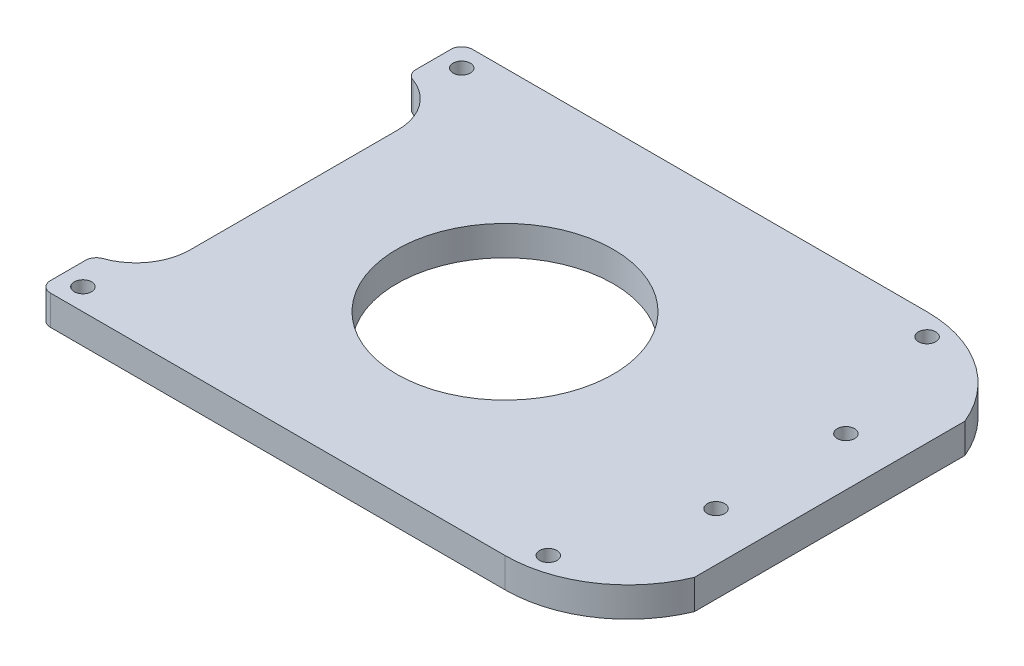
ISO-10303-21;
HEADER;
FILE_DESCRIPTION(('STEP AP214'),'2;1');
FILE_NAME('part.step','',(''),(''),'','','');
FILE_SCHEMA(('AUTOMOTIVE_DESIGN { 1 0 10303 214 1 1 1 1 }'));
ENDSEC;
DATA;
#1=APPLICATION_CONTEXT('core data for automotive mechanical design processes');
#2=APPLICATION_PROTOCOL_DEFINITION('international standard','automotive_design',2000,#1);
#3=PRODUCT_CONTEXT('',#1,'mechanical');
#4=PRODUCT('Part','Part','',(#3));
#5=PRODUCT_RELATED_PRODUCT_CATEGORY('part','',(#4));
#6=PRODUCT_DEFINITION_FORMATION('','',#4);
#7=PRODUCT_DEFINITION_CONTEXT('part definition',#1,'design');
#8=PRODUCT_DEFINITION('design','',#6,#7);
#9=PRODUCT_DEFINITION_SHAPE('','',#8);
#10=(LENGTH_UNIT() NAMED_UNIT(*) SI_UNIT(.MILLI.,.METRE.));
#11=(NAMED_UNIT(*) PLANE_ANGLE_UNIT() SI_UNIT($,.RADIAN.));
#12=(NAMED_UNIT(*) SI_UNIT($,.STERADIAN.) SOLID_ANGLE_UNIT());
#13=UNCERTAINTY_MEASURE_WITH_UNIT(LENGTH_MEASURE(1.E-05),#10,'distance_accuracy_value','');
#14=(GEOMETRIC_REPRESENTATION_CONTEXT(3) GLOBAL_UNCERTAINTY_ASSIGNED_CONTEXT((#13)) GLOBAL_UNIT_ASSIGNED_CONTEXT((#10,
#11,#12)) REPRESENTATION_CONTEXT('',''));
#15=CARTESIAN_POINT('',(0.,0.,0.));
#16=DIRECTION('',(0.,0.,1.));
#17=DIRECTION('',(1.,0.,0.));
#18=AXIS2_PLACEMENT_3D('',#15,#16,#17);
#19=CARTESIAN_POINT('',(39.,5.5,-16.25));
#20=DIRECTION('',(0.,-1.,0.));
#21=DIRECTION('',(0.,0.,-1.));
#22=AXIS2_PLACEMENT_3D('',#19,#20,#21);
#23=PLANE('',#22);
#24=DIRECTION('',(-1.,0.,0.));
#25=VECTOR('',#24,1.);
#26=CARTESIAN_POINT('',(-39.,5.5,-39.));
#27=LINE('',#26,#25);
#28=CARTESIAN_POINT('',(39.,5.5,-39.));
#29=VERTEX_POINT('',#28);
#30=CARTESIAN_POINT('',(-45.,5.5,-39.));
#31=VERTEX_POINT('',#30);
#32=EDGE_CURVE('E205',#29,#31,#27,.T.);
#33=ORIENTED_EDGE('',*,*,#32,.T.);
#34=CARTESIAN_POINT('',(-45.,5.5,-37.));
#35=DIRECTION('',(0.,-1.,0.));
#36=DIRECTION('',(0.,0.,-1.));
#37=AXIS2_PLACEMENT_3D('',#34,#35,#36);
#38=CIRCLE('',#37,2.);
#39=CARTESIAN_POINT('',(-47.,5.5,-37.));
#40=VERTEX_POINT('',#39);
#41=EDGE_CURVE('E11',#31,#40,#38,.F.);
#42=ORIENTED_EDGE('',*,*,#41,.T.);
#43=DIRECTION('',(0.,0.,1.));
#44=VECTOR('',#43,1.);
#45=CARTESIAN_POINT('',(-47.,5.5,-39.));
#46=LINE('',#45,#44);
#47=CARTESIAN_POINT('',(-47.,5.5,-30.515749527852));
#48=VERTEX_POINT('',#47);
#49=EDGE_CURVE('E286',#40,#48,#46,.T.);
#50=ORIENTED_EDGE('',*,*,#49,.T.);
#51=CARTESIAN_POINT('',(-45.,5.5,-30.515749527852));
#52=DIRECTION('',(0.,-1.,0.));
#53=DIRECTION('',(0.,0.,-1.));
#54=AXIS2_PLACEMENT_3D('',#51,#52,#53);
#55=CIRCLE('',#54,2.);
#56=CARTESIAN_POINT('',(-45.6666666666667,5.5,-28.6301314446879));
#57=VERTEX_POINT('',#56);
#58=EDGE_CURVE('E273',#48,#57,#55,.F.);
#59=ORIENTED_EDGE('',*,*,#58,.T.);
#60=CARTESIAN_POINT('',(-49.,5.5,-19.2020410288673));
#61=DIRECTION('',(0.,-1.,0.));
#62=DIRECTION('',(0.,0.,-1.));
#63=AXIS2_PLACEMENT_3D('',#60,#61,#62);
#64=CIRCLE('',#63,10.);
#65=CARTESIAN_POINT('',(-39.,5.5,-19.2020410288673));
#66=VERTEX_POINT('',#65);
#67=EDGE_CURVE('E232',#57,#66,#64,.T.);
#68=ORIENTED_EDGE('',*,*,#67,.T.);
#69=DIRECTION('',(0.,0.,1.));
#70=VECTOR('',#69,1.);
#71=CARTESIAN_POINT('',(-39.,5.5,29.));
#72=LINE('',#71,#70);
#73=CARTESIAN_POINT('',(-39.,5.5,19.2020410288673));
#74=VERTEX_POINT('',#73);
#75=EDGE_CURVE('E306',#66,#74,#72,.T.);
#76=ORIENTED_EDGE('',*,*,#75,.T.);
#77=CARTESIAN_POINT('',(-49.,5.5,19.2020410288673));
#78=DIRECTION('',(0.,-1.,0.));
#79=DIRECTION('',(0.,0.,-1.));
#80=AXIS2_PLACEMENT_3D('',#77,#78,#79);
#81=CIRCLE('',#80,10.);
#82=CARTESIAN_POINT('',(-45.6666666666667,5.5,28.6301314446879));
#83=VERTEX_POINT('',#82);
#84=EDGE_CURVE('E224',#74,#83,#81,.T.);
#85=ORIENTED_EDGE('',*,*,#84,.T.);
#86=CARTESIAN_POINT('',(-45.,5.5,30.5157495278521));
#87=DIRECTION('',(0.,-1.,0.));
#88=DIRECTION('',(0.,0.,-1.));
#89=AXIS2_PLACEMENT_3D('',#86,#87,#88);
#90=CIRCLE('',#89,2.);
#91=CARTESIAN_POINT('',(-47.,5.5,30.5157495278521));
#92=VERTEX_POINT('',#91);
#93=EDGE_CURVE('E258',#83,#92,#90,.F.);
#94=ORIENTED_EDGE('',*,*,#93,.T.);
#95=DIRECTION('',(0.,0.,1.));
#96=VECTOR('',#95,1.);
#97=CARTESIAN_POINT('',(-47.,5.5,39.));
#98=LINE('',#97,#96);
#99=CARTESIAN_POINT('',(-47.,5.5,37.));
#100=VERTEX_POINT('',#99);
#101=EDGE_CURVE('E151',#92,#100,#98,.T.);
#102=ORIENTED_EDGE('',*,*,#101,.T.);
#103=CARTESIAN_POINT('',(-45.,5.5,37.));
#104=DIRECTION('',(0.,-1.,0.));
#105=DIRECTION('',(0.,0.,-1.));
#106=AXIS2_PLACEMENT_3D('',#103,#104,#105);
#107=CIRCLE('',#106,2.);
#108=CARTESIAN_POINT('',(-45.,5.5,39.));
#109=VERTEX_POINT('',#108);
#110=EDGE_CURVE('E146',#100,#109,#107,.F.);
#111=ORIENTED_EDGE('',*,*,#110,.T.);
#112=DIRECTION('',(1.,0.,0.));
#113=VECTOR('',#112,1.);
#114=CARTESIAN_POINT('',(-39.,5.5,39.));
#115=LINE('',#114,#113);
#116=CARTESIAN_POINT('',(39.,5.5,39.));
#117=VERTEX_POINT('',#116);
#118=EDGE_CURVE('E139',#109,#117,#115,.T.);
#119=ORIENTED_EDGE('',*,*,#118,.T.);
#120=CARTESIAN_POINT('',(39.,5.5,16.25));
#121=DIRECTION('',(0.,1.,0.));
#122=DIRECTION('',(0.,0.,1.));
#123=AXIS2_PLACEMENT_3D('',#120,#121,#122);
#124=CIRCLE('',#123,22.75);
#125=CARTESIAN_POINT('',(60.,5.5,25.));
#126=VERTEX_POINT('',#125);
#127=EDGE_CURVE('E143',#117,#126,#124,.T.);
#128=ORIENTED_EDGE('',*,*,#127,.T.);
#129=DIRECTION('',(0.,0.,-1.));
#130=VECTOR('',#129,1.);
#131=CARTESIAN_POINT('',(60.,5.5,0.));
#132=LINE('',#131,#130);
#133=CARTESIAN_POINT('',(60.,5.5,-25.));
#134=VERTEX_POINT('',#133);
#135=EDGE_CURVE('E169',#126,#134,#132,.T.);
#136=ORIENTED_EDGE('',*,*,#135,.T.);
#137=CARTESIAN_POINT('',(39.,5.5,-16.25));
#138=DIRECTION('',(0.,1.,0.));
#139=DIRECTION('',(0.,0.,-1.));
#140=AXIS2_PLACEMENT_3D('',#137,#138,#139);
#141=CIRCLE('',#140,22.75);
#142=EDGE_CURVE('E172',#134,#29,#141,.T.);
#143=ORIENTED_EDGE('',*,*,#142,.T.);
#144=EDGE_LOOP('',(#33,#42,#50,#59,#68,#76,#85,#94,#102,#111,#119,#128,#136,#143));
#145=FACE_BOUND('',#144,.T.);
#146=CARTESIAN_POINT('',(51.,5.5,-12.));
#147=DIRECTION('',(0.,1.,0.));
#148=DIRECTION('',(0.,0.,1.));
#149=AXIS2_PLACEMENT_3D('',#146,#147,#148);
#150=CIRCLE('',#149,1.6);
#151=CARTESIAN_POINT('',(51.,5.5,-10.4));
#152=VERTEX_POINT('',#151);
#153=EDGE_CURVE('E184',#152,#152,#150,.T.);
#154=ORIENTED_EDGE('',*,*,#153,.F.);
#155=EDGE_LOOP('',(#154));
#156=FACE_BOUND('',#155,.T.);
#157=CARTESIAN_POINT('',(51.,5.5,12.));
#158=DIRECTION('',(0.,1.,0.));
#159=DIRECTION('',(0.,0.,1.));
#160=AXIS2_PLACEMENT_3D('',#157,#158,#159);
#161=CIRCLE('',#160,1.6);
#162=CARTESIAN_POINT('',(51.,5.5,13.6));
#163=VERTEX_POINT('',#162);
#164=EDGE_CURVE('E333',#163,#163,#161,.T.);
#165=ORIENTED_EDGE('',*,*,#164,.F.);
#166=EDGE_LOOP('',(#165));
#167=FACE_BOUND('',#166,.T.);
#168=CARTESIAN_POINT('',(0.,5.5,0.));
#169=DIRECTION('',(0.,1.,0.));
#170=DIRECTION('',(0.,0.,1.));
#171=AXIS2_PLACEMENT_3D('',#168,#169,#170);
#172=CIRCLE('',#171,20.);
#173=CARTESIAN_POINT('',(0.,5.5,20.));
#174=VERTEX_POINT('',#173);
#175=EDGE_CURVE('E341',#174,#174,#172,.T.);
#176=ORIENTED_EDGE('',*,*,#175,.F.);
#177=EDGE_LOOP('',(#176));
#178=FACE_BOUND('',#177,.T.);
#179=CARTESIAN_POINT('',(43.,5.5,-35.));
#180=DIRECTION('',(0.,1.,0.));
#181=DIRECTION('',(0.,0.,1.));
#182=AXIS2_PLACEMENT_3D('',#179,#180,#181);
#183=CIRCLE('',#182,1.6);
#184=CARTESIAN_POINT('',(43.,5.5,-33.4));
#185=VERTEX_POINT('',#184);
#186=EDGE_CURVE('E349',#185,#185,#183,.T.);
#187=ORIENTED_EDGE('',*,*,#186,.F.);
#188=EDGE_LOOP('',(#187));
#189=FACE_BOUND('',#188,.T.);
#190=CARTESIAN_POINT('',(43.,5.5,35.));
#191=DIRECTION('',(0.,1.,0.));
#192=DIRECTION('',(0.,0.,1.));
#193=AXIS2_PLACEMENT_3D('',#190,#191,#192);
#194=CIRCLE('',#193,1.6);
#195=CARTESIAN_POINT('',(43.,5.5,36.6));
#196=VERTEX_POINT('',#195);
#197=EDGE_CURVE('E357',#196,#196,#194,.T.);
#198=ORIENTED_EDGE('',*,*,#197,.F.);
#199=EDGE_LOOP('',(#198));
#200=FACE_BOUND('',#199,.T.);
#201=CARTESIAN_POINT('',(-43.,5.5,35.));
#202=DIRECTION('',(0.,1.,0.));
#203=DIRECTION('',(0.,0.,-1.));
#204=AXIS2_PLACEMENT_3D('',#201,#202,#203);
#205=CIRCLE('',#204,1.6);
#206=CARTESIAN_POINT('',(-43.,5.5,33.4));
#207=VERTEX_POINT('',#206);
#208=EDGE_CURVE('E365',#207,#207,#205,.T.);
#209=ORIENTED_EDGE('',*,*,#208,.F.);
#210=EDGE_LOOP('',(#209));
#211=FACE_BOUND('',#210,.T.);
#212=CARTESIAN_POINT('',(-43.,5.5,-35.));
#213=DIRECTION('',(0.,1.,0.));
#214=DIRECTION('',(0.,0.,-1.));
#215=AXIS2_PLACEMENT_3D('',#212,#213,#214);
#216=CIRCLE('',#215,1.6);
#217=CARTESIAN_POINT('',(-43.,5.5,-36.6));
#218=VERTEX_POINT('',#217);
#219=EDGE_CURVE('E373',#218,#218,#216,.T.);
#220=ORIENTED_EDGE('',*,*,#219,.F.);
#221=EDGE_LOOP('',(#220));
#222=FACE_BOUND('',#221,.T.);
#223=ADVANCED_FACE('F39',(#145,#156,#167,#178,#189,#200,#211,#222),#23,.F.);
#224=CARTESIAN_POINT('',(39.,0.,-16.25));
#225=DIRECTION('',(0.,-1.,0.));
#226=DIRECTION('',(0.,0.,-1.));
#227=AXIS2_PLACEMENT_3D('',#224,#225,#226);
#228=PLANE('',#227);
#229=CARTESIAN_POINT('',(-43.,0.,35.));
#230=DIRECTION('',(0.,1.,0.));
#231=DIRECTION('',(0.,0.,-1.));
#232=AXIS2_PLACEMENT_3D('',#229,#230,#231);
#233=CIRCLE('',#232,1.6);
#234=CARTESIAN_POINT('',(-43.,0.,33.4));
#235=VERTEX_POINT('',#234);
#236=EDGE_CURVE('E369',#235,#235,#233,.T.);
#237=ORIENTED_EDGE('',*,*,#236,.T.);
#238=EDGE_LOOP('',(#237));
#239=FACE_BOUND('',#238,.T.);
#240=CARTESIAN_POINT('',(43.,0.,-35.));
#241=DIRECTION('',(0.,1.,0.));
#242=DIRECTION('',(0.,0.,1.));
#243=AXIS2_PLACEMENT_3D('',#240,#241,#242);
#244=CIRCLE('',#243,1.6);
#245=CARTESIAN_POINT('',(43.,0.,-33.4));
#246=VERTEX_POINT('',#245);
#247=EDGE_CURVE('E353',#246,#246,#244,.T.);
#248=ORIENTED_EDGE('',*,*,#247,.T.);
#249=EDGE_LOOP('',(#248));
#250=FACE_BOUND('',#249,.T.);
#251=CARTESIAN_POINT('',(51.,0.,12.));
#252=DIRECTION('',(0.,1.,0.));
#253=DIRECTION('',(0.,0.,1.));
#254=AXIS2_PLACEMENT_3D('',#251,#252,#253);
#255=CIRCLE('',#254,1.6);
#256=CARTESIAN_POINT('',(51.,0.,13.6));
#257=VERTEX_POINT('',#256);
#258=EDGE_CURVE('E337',#257,#257,#255,.T.);
#259=ORIENTED_EDGE('',*,*,#258,.T.);
#260=EDGE_LOOP('',(#259));
#261=FACE_BOUND('',#260,.T.);
#262=DIRECTION('',(0.,0.,1.));
#263=VECTOR('',#262,1.);
#264=CARTESIAN_POINT('',(-47.,0.,-39.));
#265=LINE('',#264,#263);
#266=CARTESIAN_POINT('',(-47.,0.,-37.));
#267=VERTEX_POINT('',#266);
#268=CARTESIAN_POINT('',(-47.,0.,-30.515749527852));
#269=VERTEX_POINT('',#268);
#270=EDGE_CURVE('E180',#267,#269,#265,.T.);
#271=ORIENTED_EDGE('',*,*,#270,.F.);
#272=CARTESIAN_POINT('',(-45.,0.,-37.));
#273=DIRECTION('',(0.,-1.,0.));
#274=DIRECTION('',(0.,0.,-1.));
#275=AXIS2_PLACEMENT_3D('',#272,#273,#274);
#276=CIRCLE('',#275,2.);
#277=CARTESIAN_POINT('',(-45.,0.,-39.));
#278=VERTEX_POINT('',#277);
#279=EDGE_CURVE('E62',#267,#278,#276,.T.);
#280=ORIENTED_EDGE('',*,*,#279,.T.);
#281=DIRECTION('',(-1.,0.,0.));
#282=VECTOR('',#281,1.);
#283=CARTESIAN_POINT('',(0.,0.,-39.));
#284=LINE('',#283,#282);
#285=CARTESIAN_POINT('',(39.,0.,-39.));
#286=VERTEX_POINT('',#285);
#287=EDGE_CURVE('E202',#286,#278,#284,.T.);
#288=ORIENTED_EDGE('',*,*,#287,.F.);
#289=CARTESIAN_POINT('',(39.,0.,-16.25));
#290=DIRECTION('',(0.,1.,0.));
#291=DIRECTION('',(0.,0.,-1.));
#292=AXIS2_PLACEMENT_3D('',#289,#290,#291);
#293=CIRCLE('',#292,22.75);
#294=CARTESIAN_POINT('',(60.,0.,-25.));
#295=VERTEX_POINT('',#294);
#296=EDGE_CURVE('E199',#295,#286,#293,.T.);
#297=ORIENTED_EDGE('',*,*,#296,.F.);
#298=DIRECTION('',(0.,0.,-1.));
#299=VECTOR('',#298,1.);
#300=CARTESIAN_POINT('',(60.,0.,0.));
#301=LINE('',#300,#299);
#302=CARTESIAN_POINT('',(60.,0.,25.));
#303=VERTEX_POINT('',#302);
#304=EDGE_CURVE('E196',#303,#295,#301,.T.);
#305=ORIENTED_EDGE('',*,*,#304,.F.);
#306=CARTESIAN_POINT('',(39.,0.,16.25));
#307=DIRECTION('',(0.,1.,0.));
#308=DIRECTION('',(0.,0.,1.));
#309=AXIS2_PLACEMENT_3D('',#306,#307,#308);
#310=CIRCLE('',#309,22.75);
#311=CARTESIAN_POINT('',(39.,0.,39.));
#312=VERTEX_POINT('',#311);
#313=EDGE_CURVE('E193',#312,#303,#310,.T.);
#314=ORIENTED_EDGE('',*,*,#313,.F.);
#315=DIRECTION('',(1.,0.,0.));
#316=VECTOR('',#315,1.);
#317=CARTESIAN_POINT('',(39.,0.,39.));
#318=LINE('',#317,#316);
#319=CARTESIAN_POINT('',(-45.,0.,39.));
#320=VERTEX_POINT('',#319);
#321=EDGE_CURVE('E157',#320,#312,#318,.T.);
#322=ORIENTED_EDGE('',*,*,#321,.F.);
#323=CARTESIAN_POINT('',(-45.,0.,37.));
#324=DIRECTION('',(0.,-1.,0.));
#325=DIRECTION('',(0.,0.,-1.));
#326=AXIS2_PLACEMENT_3D('',#323,#324,#325);
#327=CIRCLE('',#326,2.);
#328=CARTESIAN_POINT('',(-47.,0.,37.));
#329=VERTEX_POINT('',#328);
#330=EDGE_CURVE('E238',#320,#329,#327,.T.);
#331=ORIENTED_EDGE('',*,*,#330,.T.);
#332=DIRECTION('',(0.,0.,1.));
#333=VECTOR('',#332,1.);
#334=CARTESIAN_POINT('',(-47.,0.,39.));
#335=LINE('',#334,#333);
#336=CARTESIAN_POINT('',(-47.,0.,30.5157495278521));
#337=VERTEX_POINT('',#336);
#338=EDGE_CURVE('E188',#337,#329,#335,.T.);
#339=ORIENTED_EDGE('',*,*,#338,.F.);
#340=CARTESIAN_POINT('',(-45.,0.,30.5157495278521));
#341=DIRECTION('',(0.,-1.,0.));
#342=DIRECTION('',(0.,0.,-1.));
#343=AXIS2_PLACEMENT_3D('',#340,#341,#342);
#344=CIRCLE('',#343,2.);
#345=CARTESIAN_POINT('',(-45.6666666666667,0.,28.6301314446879));
#346=VERTEX_POINT('',#345);
#347=EDGE_CURVE('E252',#337,#346,#344,.T.);
#348=ORIENTED_EDGE('',*,*,#347,.T.);
#349=CARTESIAN_POINT('',(-49.,0.,19.2020410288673));
#350=DIRECTION('',(0.,-1.,0.));
#351=DIRECTION('',(0.,0.,-1.));
#352=AXIS2_PLACEMENT_3D('',#349,#350,#351);
#353=CIRCLE('',#352,10.);
#354=CARTESIAN_POINT('',(-39.,0.,19.2020410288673));
#355=VERTEX_POINT('',#354);
#356=EDGE_CURVE('E221',#346,#355,#353,.F.);
#357=ORIENTED_EDGE('',*,*,#356,.T.);
#358=DIRECTION('',(0.,0.,1.));
#359=VECTOR('',#358,1.);
#360=CARTESIAN_POINT('',(-39.,0.,29.));
#361=LINE('',#360,#359);
#362=CARTESIAN_POINT('',(-39.,0.,-19.2020410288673));
#363=VERTEX_POINT('',#362);
#364=EDGE_CURVE('E183',#363,#355,#361,.T.);
#365=ORIENTED_EDGE('',*,*,#364,.F.);
#366=CARTESIAN_POINT('',(-49.,0.,-19.2020410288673));
#367=DIRECTION('',(0.,-1.,0.));
#368=DIRECTION('',(0.,0.,-1.));
#369=AXIS2_PLACEMENT_3D('',#366,#367,#368);
#370=CIRCLE('',#369,10.);
#371=CARTESIAN_POINT('',(-45.6666666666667,0.,-28.6301314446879));
#372=VERTEX_POINT('',#371);
#373=EDGE_CURVE('E228',#363,#372,#370,.F.);
#374=ORIENTED_EDGE('',*,*,#373,.T.);
#375=CARTESIAN_POINT('',(-45.,0.,-30.515749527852));
#376=DIRECTION('',(0.,-1.,0.));
#377=DIRECTION('',(0.,0.,-1.));
#378=AXIS2_PLACEMENT_3D('',#375,#376,#377);
#379=CIRCLE('',#378,2.);
#380=EDGE_CURVE('E265',#372,#269,#379,.T.);
#381=ORIENTED_EDGE('',*,*,#380,.T.);
#382=EDGE_LOOP('',(#271,#280,#288,#297,#305,#314,#322,#331,#339,#348,#357,#365,#374,#381));
#383=FACE_BOUND('',#382,.T.);
#384=CARTESIAN_POINT('',(51.,0.,-12.));
#385=DIRECTION('',(0.,1.,0.));
#386=DIRECTION('',(0.,0.,1.));
#387=AXIS2_PLACEMENT_3D('',#384,#385,#386);
#388=CIRCLE('',#387,1.6);
#389=CARTESIAN_POINT('',(51.,0.,-10.4));
#390=VERTEX_POINT('',#389);
#391=EDGE_CURVE('E329',#390,#390,#388,.T.);
#392=ORIENTED_EDGE('',*,*,#391,.T.);
#393=EDGE_LOOP('',(#392));
#394=FACE_BOUND('',#393,.T.);
#395=CARTESIAN_POINT('',(0.,0.,0.));
#396=DIRECTION('',(0.,1.,0.));
#397=DIRECTION('',(0.,0.,1.));
#398=AXIS2_PLACEMENT_3D('',#395,#396,#397);
#399=CIRCLE('',#398,20.);
#400=CARTESIAN_POINT('',(0.,0.,20.));
#401=VERTEX_POINT('',#400);
#402=EDGE_CURVE('E345',#401,#401,#399,.T.);
#403=ORIENTED_EDGE('',*,*,#402,.T.);
#404=EDGE_LOOP('',(#403));
#405=FACE_BOUND('',#404,.T.);
#406=CARTESIAN_POINT('',(43.,0.,35.));
#407=DIRECTION('',(0.,1.,0.));
#408=DIRECTION('',(0.,0.,1.));
#409=AXIS2_PLACEMENT_3D('',#406,#407,#408);
#410=CIRCLE('',#409,1.6);
#411=CARTESIAN_POINT('',(43.,0.,36.6));
#412=VERTEX_POINT('',#411);
#413=EDGE_CURVE('E361',#412,#412,#410,.T.);
#414=ORIENTED_EDGE('',*,*,#413,.T.);
#415=EDGE_LOOP('',(#414));
#416=FACE_BOUND('',#415,.T.);
#417=CARTESIAN_POINT('',(-43.,0.,-35.));
#418=DIRECTION('',(0.,1.,0.));
#419=DIRECTION('',(0.,0.,-1.));
#420=AXIS2_PLACEMENT_3D('',#417,#418,#419);
#421=CIRCLE('',#420,1.6);
#422=CARTESIAN_POINT('',(-43.,0.,-36.6));
#423=VERTEX_POINT('',#422);
#424=EDGE_CURVE('E377',#423,#423,#421,.T.);
#425=ORIENTED_EDGE('',*,*,#424,.T.);
#426=EDGE_LOOP('',(#425));
#427=FACE_BOUND('',#426,.T.);
#428=ADVANCED_FACE('F289',(#239,#250,#261,#383,#394,#405,#416,#427),#228,.T.);
#429=CARTESIAN_POINT('',(-47.,5.5,-39.));
#430=DIRECTION('',(1.,0.,0.));
#431=DIRECTION('',(0.,0.,-1.));
#432=AXIS2_PLACEMENT_3D('',#429,#430,#431);
#433=PLANE('',#432);
#434=ORIENTED_EDGE('',*,*,#49,.F.);
#435=DIRECTION('',(0.,-1.,0.));
#436=VECTOR('',#435,1.);
#437=CARTESIAN_POINT('',(-47.,5.5,-37.));
#438=LINE('',#437,#436);
#439=EDGE_CURVE('E276',#40,#267,#438,.T.);
#440=ORIENTED_EDGE('',*,*,#439,.T.);
#441=ORIENTED_EDGE('',*,*,#270,.T.);
#442=DIRECTION('',(0.,-1.,0.));
#443=VECTOR('',#442,1.);
#444=CARTESIAN_POINT('',(-47.,5.5,-30.515749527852));
#445=LINE('',#444,#443);
#446=EDGE_CURVE('E269',#269,#48,#445,.F.);
#447=ORIENTED_EDGE('',*,*,#446,.T.);
#448=EDGE_LOOP('',(#434,#440,#441,#447));
#449=FACE_BOUND('',#448,.T.);
#450=ADVANCED_FACE('F285',(#449),#433,.F.);
#451=CARTESIAN_POINT('',(-39.,5.5,29.));
#452=DIRECTION('',(1.,0.,0.));
#453=DIRECTION('',(0.,0.,-1.));
#454=AXIS2_PLACEMENT_3D('',#451,#452,#453);
#455=PLANE('',#454);
#456=ORIENTED_EDGE('',*,*,#364,.T.);
#457=DIRECTION('',(0.,1.,0.));
#458=VECTOR('',#457,1.);
#459=CARTESIAN_POINT('',(-39.,5.5,19.2020410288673));
#460=LINE('',#459,#458);
#461=EDGE_CURVE('E218',#355,#74,#460,.T.);
#462=ORIENTED_EDGE('',*,*,#461,.T.);
#463=ORIENTED_EDGE('',*,*,#75,.F.);
#464=DIRECTION('',(0.,-1.,0.));
#465=VECTOR('',#464,1.);
#466=CARTESIAN_POINT('',(-39.,5.5,-19.2020410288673));
#467=LINE('',#466,#465);
#468=EDGE_CURVE('E162',#66,#363,#467,.T.);
#469=ORIENTED_EDGE('',*,*,#468,.T.);
#470=EDGE_LOOP('',(#456,#462,#463,#469));
#471=FACE_BOUND('',#470,.T.);
#472=ADVANCED_FACE('F304',(#471),#455,.F.);
#473=CARTESIAN_POINT('',(-47.,5.5,39.));
#474=DIRECTION('',(1.,0.,0.));
#475=DIRECTION('',(0.,0.,-1.));
#476=AXIS2_PLACEMENT_3D('',#473,#474,#475);
#477=PLANE('',#476);
#478=ORIENTED_EDGE('',*,*,#101,.F.);
#479=DIRECTION('',(0.,1.,0.));
#480=VECTOR('',#479,1.);
#481=CARTESIAN_POINT('',(-47.,5.5,30.5157495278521));
#482=LINE('',#481,#480);
#483=EDGE_CURVE('E248',#92,#337,#482,.F.);
#484=ORIENTED_EDGE('',*,*,#483,.T.);
#485=ORIENTED_EDGE('',*,*,#338,.T.);
#486=DIRECTION('',(0.,-1.,0.));
#487=VECTOR('',#486,1.);
#488=CARTESIAN_POINT('',(-47.,5.5,37.));
#489=LINE('',#488,#487);
#490=EDGE_CURVE('E242',#329,#100,#489,.F.);
#491=ORIENTED_EDGE('',*,*,#490,.T.);
#492=EDGE_LOOP('',(#478,#484,#485,#491));
#493=FACE_BOUND('',#492,.T.);
#494=ADVANCED_FACE('F319',(#493),#477,.F.);
#495=CARTESIAN_POINT('',(39.,5.5,39.));
#496=DIRECTION('',(0.,0.,-1.));
#497=DIRECTION('',(-1.,0.,0.));
#498=AXIS2_PLACEMENT_3D('',#495,#496,#497);
#499=PLANE('',#498);
#500=ORIENTED_EDGE('',*,*,#118,.F.);
#501=DIRECTION('',(0.,-1.,0.));
#502=VECTOR('',#501,1.);
#503=CARTESIAN_POINT('',(-45.,5.5,39.));
#504=LINE('',#503,#502);
#505=EDGE_CURVE('E235',#109,#320,#504,.T.);
#506=ORIENTED_EDGE('',*,*,#505,.T.);
#507=ORIENTED_EDGE('',*,*,#321,.T.);
#508=DIRECTION('',(0.,-1.,0.));
#509=VECTOR('',#508,1.);
#510=CARTESIAN_POINT('',(39.,5.5,39.));
#511=LINE('',#510,#509);
#512=EDGE_CURVE('E154',#117,#312,#511,.T.);
#513=ORIENTED_EDGE('',*,*,#512,.F.);
#514=EDGE_LOOP('',(#500,#506,#507,#513));
#515=FACE_BOUND('',#514,.T.);
#516=ADVANCED_FACE('F155',(#515),#499,.F.);
#517=CARTESIAN_POINT('',(39.,5.5,16.25));
#518=DIRECTION('',(0.,-1.,0.));
#519=DIRECTION('',(0.,0.,-1.));
#520=AXIS2_PLACEMENT_3D('',#517,#518,#519);
#521=CYLINDRICAL_SURFACE('',#520,22.75);
#522=ORIENTED_EDGE('',*,*,#313,.T.);
#523=DIRECTION('',(0.,-1.,0.));
#524=VECTOR('',#523,1.);
#525=CARTESIAN_POINT('',(60.,5.5,25.));
#526=LINE('',#525,#524);
#527=EDGE_CURVE('E163',#126,#303,#526,.T.);
#528=ORIENTED_EDGE('',*,*,#527,.F.);
#529=ORIENTED_EDGE('',*,*,#127,.F.);
#530=ORIENTED_EDGE('',*,*,#512,.T.);
#531=EDGE_LOOP('',(#522,#528,#529,#530));
#532=FACE_BOUND('',#531,.T.);
#533=ADVANCED_FACE('F165',(#532),#521,.T.);
#534=CARTESIAN_POINT('',(60.,5.5,0.));
#535=DIRECTION('',(-1.,0.,0.));
#536=DIRECTION('',(0.,0.,1.));
#537=AXIS2_PLACEMENT_3D('',#534,#535,#536);
#538=PLANE('',#537);
#539=ORIENTED_EDGE('',*,*,#304,.T.);
#540=DIRECTION('',(0.,-1.,0.));
#541=VECTOR('',#540,1.);
#542=CARTESIAN_POINT('',(60.,5.5,-25.));
#543=LINE('',#542,#541);
#544=EDGE_CURVE('E209',#134,#295,#543,.T.);
#545=ORIENTED_EDGE('',*,*,#544,.F.);
#546=ORIENTED_EDGE('',*,*,#135,.F.);
#547=ORIENTED_EDGE('',*,*,#527,.T.);
#548=EDGE_LOOP('',(#539,#545,#546,#547));
#549=FACE_BOUND('',#548,.T.);
#550=ADVANCED_FACE('F405',(#549),#538,.F.);
#551=CARTESIAN_POINT('',(39.,5.5,-16.25));
#552=DIRECTION('',(0.,-1.,0.));
#553=DIRECTION('',(0.,0.,-1.));
#554=AXIS2_PLACEMENT_3D('',#551,#552,#553);
#555=CYLINDRICAL_SURFACE('',#554,22.75);
#556=ORIENTED_EDGE('',*,*,#296,.T.);
#557=DIRECTION('',(0.,-1.,0.));
#558=VECTOR('',#557,1.);
#559=CARTESIAN_POINT('',(39.,5.5,-39.));
#560=LINE('',#559,#558);
#561=EDGE_CURVE('E179',#29,#286,#560,.T.);
#562=ORIENTED_EDGE('',*,*,#561,.F.);
#563=ORIENTED_EDGE('',*,*,#142,.F.);
#564=ORIENTED_EDGE('',*,*,#544,.T.);
#565=EDGE_LOOP('',(#556,#562,#563,#564));
#566=FACE_BOUND('',#565,.T.);
#567=ADVANCED_FACE('F402',(#566),#555,.T.);
#568=CARTESIAN_POINT('',(0.,5.5,-39.));
#569=DIRECTION('',(0.,0.,1.));
#570=DIRECTION('',(1.,0.,0.));
#571=AXIS2_PLACEMENT_3D('',#568,#569,#570);
#572=PLANE('',#571);
#573=ORIENTED_EDGE('',*,*,#287,.T.);
#574=DIRECTION('',(0.,-1.,0.));
#575=VECTOR('',#574,1.);
#576=CARTESIAN_POINT('',(-45.,5.5,-39.));
#577=LINE('',#576,#575);
#578=EDGE_CURVE('E48',#278,#31,#577,.F.);
#579=ORIENTED_EDGE('',*,*,#578,.T.);
#580=ORIENTED_EDGE('',*,*,#32,.F.);
#581=ORIENTED_EDGE('',*,*,#561,.T.);
#582=EDGE_LOOP('',(#573,#579,#580,#581));
#583=FACE_BOUND('',#582,.T.);
#584=ADVANCED_FACE('F399',(#583),#572,.F.);
#585=CARTESIAN_POINT('',(51.,5.5,-12.));
#586=DIRECTION('',(0.,-1.,0.));
#587=DIRECTION('',(0.,0.,-1.));
#588=AXIS2_PLACEMENT_3D('',#585,#586,#587);
#589=CYLINDRICAL_SURFACE('',#588,1.6);
#590=ORIENTED_EDGE('',*,*,#153,.T.);
#591=EDGE_LOOP('',(#590));
#592=FACE_BOUND('',#591,.T.);
#593=ORIENTED_EDGE('',*,*,#391,.F.);
#594=EDGE_LOOP('',(#593));
#595=FACE_BOUND('',#594,.T.);
#596=ADVANCED_FACE('F396',(#592,#595),#589,.F.);
#597=CARTESIAN_POINT('',(51.,5.5,12.));
#598=DIRECTION('',(0.,-1.,0.));
#599=DIRECTION('',(0.,0.,-1.));
#600=AXIS2_PLACEMENT_3D('',#597,#598,#599);
#601=CYLINDRICAL_SURFACE('',#600,1.6);
#602=ORIENTED_EDGE('',*,*,#164,.T.);
#603=EDGE_LOOP('',(#602));
#604=FACE_BOUND('',#603,.T.);
#605=ORIENTED_EDGE('',*,*,#258,.F.);
#606=EDGE_LOOP('',(#605));
#607=FACE_BOUND('',#606,.T.);
#608=ADVANCED_FACE('F560',(#604,#607),#601,.F.);
#609=CARTESIAN_POINT('',(0.,5.5,0.));
#610=DIRECTION('',(0.,-1.,0.));
#611=DIRECTION('',(0.,0.,-1.));
#612=AXIS2_PLACEMENT_3D('',#609,#610,#611);
#613=CYLINDRICAL_SURFACE('',#612,20.);
#614=ORIENTED_EDGE('',*,*,#175,.T.);
#615=EDGE_LOOP('',(#614));
#616=FACE_BOUND('',#615,.T.);
#617=ORIENTED_EDGE('',*,*,#402,.F.);
#618=EDGE_LOOP('',(#617));
#619=FACE_BOUND('',#618,.T.);
#620=ADVANCED_FACE('F550',(#616,#619),#613,.F.);
#621=CARTESIAN_POINT('',(43.,5.5,-35.));
#622=DIRECTION('',(0.,-1.,0.));
#623=DIRECTION('',(0.,0.,-1.));
#624=AXIS2_PLACEMENT_3D('',#621,#622,#623);
#625=CYLINDRICAL_SURFACE('',#624,1.6);
#626=ORIENTED_EDGE('',*,*,#186,.T.);
#627=EDGE_LOOP('',(#626));
#628=FACE_BOUND('',#627,.T.);
#629=ORIENTED_EDGE('',*,*,#247,.F.);
#630=EDGE_LOOP('',(#629));
#631=FACE_BOUND('',#630,.T.);
#632=ADVANCED_FACE('F540',(#628,#631),#625,.F.);
#633=CARTESIAN_POINT('',(43.,5.5,35.));
#634=DIRECTION('',(0.,-1.,0.));
#635=DIRECTION('',(0.,0.,-1.));
#636=AXIS2_PLACEMENT_3D('',#633,#634,#635);
#637=CYLINDRICAL_SURFACE('',#636,1.6);
#638=ORIENTED_EDGE('',*,*,#197,.T.);
#639=EDGE_LOOP('',(#638));
#640=FACE_BOUND('',#639,.T.);
#641=ORIENTED_EDGE('',*,*,#413,.F.);
#642=EDGE_LOOP('',(#641));
#643=FACE_BOUND('',#642,.T.);
#644=ADVANCED_FACE('F530',(#640,#643),#637,.F.);
#645=CARTESIAN_POINT('',(-43.,5.5,35.));
#646=DIRECTION('',(0.,-1.,0.));
#647=DIRECTION('',(0.,0.,-1.));
#648=AXIS2_PLACEMENT_3D('',#645,#646,#647);
#649=CYLINDRICAL_SURFACE('',#648,1.6);
#650=ORIENTED_EDGE('',*,*,#208,.T.);
#651=EDGE_LOOP('',(#650));
#652=FACE_BOUND('',#651,.T.);
#653=ORIENTED_EDGE('',*,*,#236,.F.);
#654=EDGE_LOOP('',(#653));
#655=FACE_BOUND('',#654,.T.);
#656=ADVANCED_FACE('F521',(#652,#655),#649,.F.);
#657=CARTESIAN_POINT('',(-43.,5.5,-35.));
#658=DIRECTION('',(0.,-1.,0.));
#659=DIRECTION('',(0.,0.,-1.));
#660=AXIS2_PLACEMENT_3D('',#657,#658,#659);
#661=CYLINDRICAL_SURFACE('',#660,1.6);
#662=ORIENTED_EDGE('',*,*,#219,.T.);
#663=EDGE_LOOP('',(#662));
#664=FACE_BOUND('',#663,.T.);
#665=ORIENTED_EDGE('',*,*,#424,.F.);
#666=EDGE_LOOP('',(#665));
#667=FACE_BOUND('',#666,.T.);
#668=ADVANCED_FACE('F385',(#664,#667),#661,.F.);
#669=CARTESIAN_POINT('',(-49.,5.5,19.2020410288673));
#670=DIRECTION('',(0.,1.,0.));
#671=DIRECTION('',(0.,0.,1.));
#672=AXIS2_PLACEMENT_3D('',#669,#670,#671);
#673=CYLINDRICAL_SURFACE('',#672,10.);
#674=ORIENTED_EDGE('',*,*,#356,.F.);
#675=DIRECTION('',(0.,1.,0.));
#676=VECTOR('',#675,1.);
#677=CARTESIAN_POINT('',(-45.6666666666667,5.5,28.6301314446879));
#678=LINE('',#677,#676);
#679=EDGE_CURVE('E255',#346,#83,#678,.T.);
#680=ORIENTED_EDGE('',*,*,#679,.T.);
#681=ORIENTED_EDGE('',*,*,#84,.F.);
#682=ORIENTED_EDGE('',*,*,#461,.F.);
#683=EDGE_LOOP('',(#674,#680,#681,#682));
#684=FACE_BOUND('',#683,.T.);
#685=ADVANCED_FACE('F311',(#684),#673,.F.);
#686=CARTESIAN_POINT('',(-49.,5.5,-19.2020410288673));
#687=DIRECTION('',(0.,-1.,0.));
#688=DIRECTION('',(0.,0.,-1.));
#689=AXIS2_PLACEMENT_3D('',#686,#687,#688);
#690=CYLINDRICAL_SURFACE('',#689,10.);
#691=ORIENTED_EDGE('',*,*,#67,.F.);
#692=DIRECTION('',(0.,-1.,0.));
#693=VECTOR('',#692,1.);
#694=CARTESIAN_POINT('',(-45.6666666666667,5.5,-28.6301314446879));
#695=LINE('',#694,#693);
#696=EDGE_CURVE('E261',#57,#372,#695,.T.);
#697=ORIENTED_EDGE('',*,*,#696,.T.);
#698=ORIENTED_EDGE('',*,*,#373,.F.);
#699=ORIENTED_EDGE('',*,*,#468,.F.);
#700=EDGE_LOOP('',(#691,#697,#698,#699));
#701=FACE_BOUND('',#700,.T.);
#702=ADVANCED_FACE('F302',(#701),#690,.F.);
#703=CARTESIAN_POINT('',(-45.,5.5,37.));
#704=DIRECTION('',(0.,-1.,0.));
#705=DIRECTION('',(0.,0.,-1.));
#706=AXIS2_PLACEMENT_3D('',#703,#704,#705);
#707=CYLINDRICAL_SURFACE('',#706,2.);
#708=ORIENTED_EDGE('',*,*,#110,.F.);
#709=ORIENTED_EDGE('',*,*,#490,.F.);
#710=ORIENTED_EDGE('',*,*,#330,.F.);
#711=ORIENTED_EDGE('',*,*,#505,.F.);
#712=EDGE_LOOP('',(#708,#709,#710,#711));
#713=FACE_BOUND('',#712,.T.);
#714=ADVANCED_FACE('F424',(#713),#707,.T.);
#715=CARTESIAN_POINT('',(-45.,5.5,30.5157495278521));
#716=DIRECTION('',(0.,1.,0.));
#717=DIRECTION('',(0.,0.,1.));
#718=AXIS2_PLACEMENT_3D('',#715,#716,#717);
#719=CYLINDRICAL_SURFACE('',#718,2.);
#720=ORIENTED_EDGE('',*,*,#93,.F.);
#721=ORIENTED_EDGE('',*,*,#679,.F.);
#722=ORIENTED_EDGE('',*,*,#347,.F.);
#723=ORIENTED_EDGE('',*,*,#483,.F.);
#724=EDGE_LOOP('',(#720,#721,#722,#723));
#725=FACE_BOUND('',#724,.T.);
#726=ADVANCED_FACE('F315',(#725),#719,.T.);
#727=CARTESIAN_POINT('',(-45.,5.5,-30.515749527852));
#728=DIRECTION('',(0.,-1.,0.));
#729=DIRECTION('',(0.,0.,-1.));
#730=AXIS2_PLACEMENT_3D('',#727,#728,#729);
#731=CYLINDRICAL_SURFACE('',#730,2.);
#732=ORIENTED_EDGE('',*,*,#58,.F.);
#733=ORIENTED_EDGE('',*,*,#446,.F.);
#734=ORIENTED_EDGE('',*,*,#380,.F.);
#735=ORIENTED_EDGE('',*,*,#696,.F.);
#736=EDGE_LOOP('',(#732,#733,#734,#735));
#737=FACE_BOUND('',#736,.T.);
#738=ADVANCED_FACE('F296',(#737),#731,.T.);
#739=CARTESIAN_POINT('',(-45.,5.5,-37.));
#740=DIRECTION('',(0.,-1.,0.));
#741=DIRECTION('',(0.,0.,-1.));
#742=AXIS2_PLACEMENT_3D('',#739,#740,#741);
#743=CYLINDRICAL_SURFACE('',#742,2.);
#744=ORIENTED_EDGE('',*,*,#41,.F.);
#745=ORIENTED_EDGE('',*,*,#578,.F.);
#746=ORIENTED_EDGE('',*,*,#279,.F.);
#747=ORIENTED_EDGE('',*,*,#439,.F.);
#748=EDGE_LOOP('',(#744,#745,#746,#747));
#749=FACE_BOUND('',#748,.T.);
#750=ADVANCED_FACE('F41',(#749),#743,.T.);
#751=CLOSED_SHELL('',(#223,#428,#450,#472,#494,#516,#533,#550,#567,#584,#596,#608,#620,#632,
#644,#656,#668,#685,#702,#714,#726,#738,#750));
#752=MANIFOLD_SOLID_BREP('B2',#751);
#753=ADVANCED_BREP_SHAPE_REPRESENTATION('',(#18,#752),#14);
#754=SHAPE_DEFINITION_REPRESENTATION(#9,#753);
ENDSEC;
END-ISO-10303-21;
